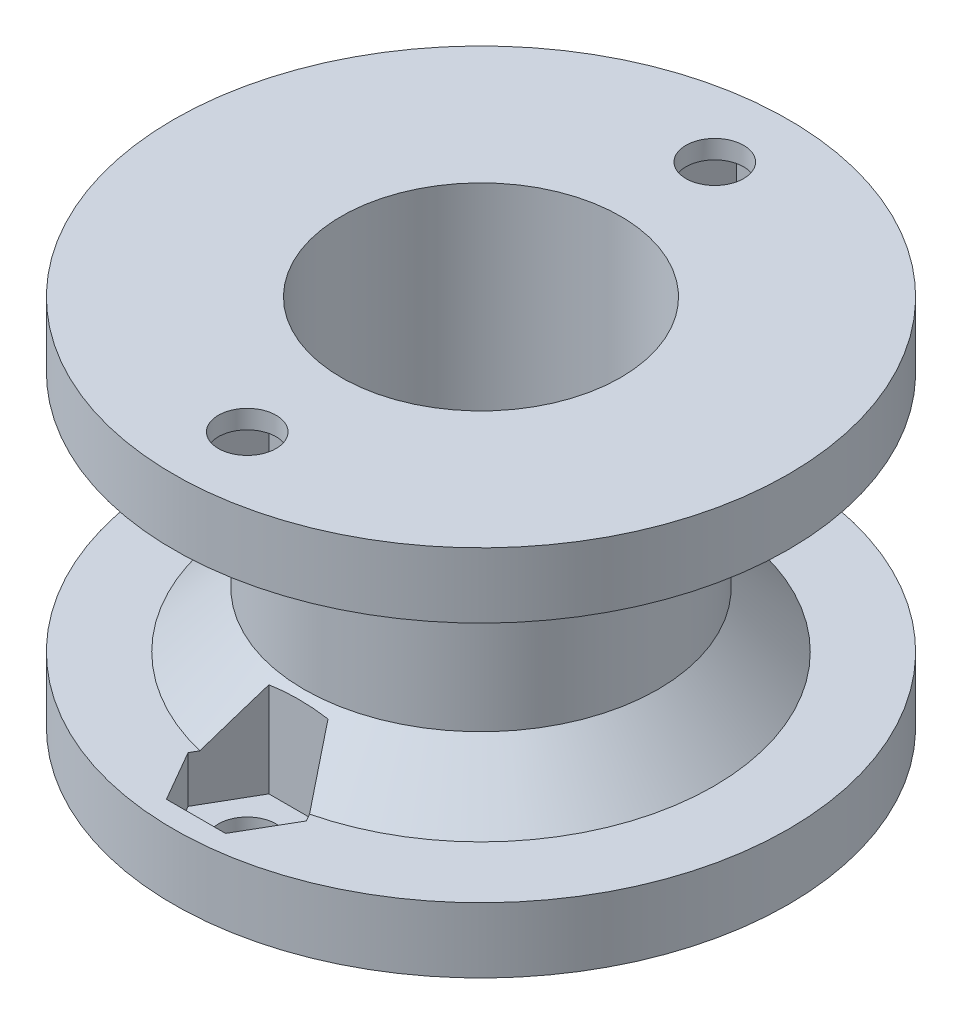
ISO-10303-21;
HEADER;
FILE_DESCRIPTION(('STEP AP214'),'2;1');
FILE_NAME('part.step','',(''),(''),'','','');
FILE_SCHEMA(('AUTOMOTIVE_DESIGN { 1 0 10303 214 1 1 1 1 }'));
ENDSEC;
DATA;
#1=APPLICATION_CONTEXT('core data for automotive mechanical design processes');
#2=APPLICATION_PROTOCOL_DEFINITION('international standard','automotive_design',2000,#1);
#3=PRODUCT_CONTEXT('',#1,'mechanical');
#4=PRODUCT('Part','Part','',(#3));
#5=PRODUCT_RELATED_PRODUCT_CATEGORY('part','',(#4));
#6=PRODUCT_DEFINITION_FORMATION('','',#4);
#7=PRODUCT_DEFINITION_CONTEXT('part definition',#1,'design');
#8=PRODUCT_DEFINITION('design','',#6,#7);
#9=PRODUCT_DEFINITION_SHAPE('','',#8);
#10=(LENGTH_UNIT() NAMED_UNIT(*) SI_UNIT(.MILLI.,.METRE.));
#11=(NAMED_UNIT(*) PLANE_ANGLE_UNIT() SI_UNIT($,.RADIAN.));
#12=(NAMED_UNIT(*) SI_UNIT($,.STERADIAN.) SOLID_ANGLE_UNIT());
#13=UNCERTAINTY_MEASURE_WITH_UNIT(LENGTH_MEASURE(1.E-05),#10,'distance_accuracy_value','');
#14=(GEOMETRIC_REPRESENTATION_CONTEXT(3) GLOBAL_UNCERTAINTY_ASSIGNED_CONTEXT((#13)) GLOBAL_UNIT_ASSIGNED_CONTEXT((#10,
#11,#12)) REPRESENTATION_CONTEXT('',''));
#15=CARTESIAN_POINT('',(0.,0.,0.));
#16=DIRECTION('',(0.,0.,1.));
#17=DIRECTION('',(1.,0.,0.));
#18=AXIS2_PLACEMENT_3D('',#15,#16,#17);
#19=CARTESIAN_POINT('',(-16.5,-6.5,0.));
#20=DIRECTION('',(0.,-1.,0.));
#21=DIRECTION('',(1.,0.,0.));
#22=AXIS2_PLACEMENT_3D('',#19,#20,#21);
#23=PLANE('',#22);
#24=CARTESIAN_POINT('',(0.,-6.5,0.));
#25=DIRECTION('',(0.,-1.,0.));
#26=DIRECTION('',(1.,0.,0.));
#27=AXIS2_PLACEMENT_3D('',#24,#25,#26);
#28=CIRCLE('',#27,16.5);
#29=CARTESIAN_POINT('',(16.5,-6.49999999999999,0.));
#30=VERTEX_POINT('',#29);
#31=EDGE_CURVE('E427',#30,#30,#28,.T.);
#32=ORIENTED_EDGE('',*,*,#31,.F.);
#33=EDGE_LOOP('',(#32));
#34=FACE_BOUND('',#33,.T.);
#35=DIRECTION('',(0.5,0.,-0.866025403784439));
#36=VECTOR('',#35,1.);
#37=CARTESIAN_POINT('',(-7.17773954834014,-6.5,5.38220958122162));
#38=LINE('',#37,#36);
#39=CARTESIAN_POINT('',(2.94360048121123,-6.5,-12.148465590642));
#40=VERTEX_POINT('',#39);
#41=CARTESIAN_POINT('',(3.17542648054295,-6.5,-12.55));
#42=VERTEX_POINT('',#41);
#43=EDGE_CURVE('E495',#40,#42,#38,.T.);
#44=ORIENTED_EDGE('',*,*,#43,.F.);
#45=CARTESIAN_POINT('',(0.,-6.5,0.));
#46=DIRECTION('',(0.,-1.,0.));
#47=DIRECTION('',(1.,0.,0.));
#48=AXIS2_PLACEMENT_3D('',#45,#46,#47);
#49=CIRCLE('',#48,12.5);
#50=CARTESIAN_POINT('',(2.94360048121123,-6.5,12.148465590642));
#51=VERTEX_POINT('',#50);
#52=EDGE_CURVE('E542',#40,#51,#49,.T.);
#53=ORIENTED_EDGE('',*,*,#52,.T.);
#54=DIRECTION('',(-0.5,0.,-0.866025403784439));
#55=VECTOR('',#54,1.);
#56=CARTESIAN_POINT('',(-7.17773954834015,-6.5,-5.38220958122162));
#57=LINE('',#56,#55);
#58=CARTESIAN_POINT('',(3.17542648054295,-6.5,12.55));
#59=VERTEX_POINT('',#58);
#60=EDGE_CURVE('E498',#59,#51,#57,.T.);
#61=ORIENTED_EDGE('',*,*,#60,.F.);
#62=DIRECTION('',(0.5,0.,-0.866025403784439));
#63=VECTOR('',#62,1.);
#64=CARTESIAN_POINT('',(3.69087926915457,-6.5,11.6572095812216));
#65=LINE('',#64,#63);
#66=CARTESIAN_POINT('',(1.58771324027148,-6.5,15.3));
#67=VERTEX_POINT('',#66);
#68=EDGE_CURVE('E502',#67,#59,#65,.T.);
#69=ORIENTED_EDGE('',*,*,#68,.F.);
#70=DIRECTION('',(1.,0.,0.));
#71=VECTOR('',#70,1.);
#72=CARTESIAN_POINT('',(-16.5,-6.5,15.3));
#73=LINE('',#72,#71);
#74=CARTESIAN_POINT('',(-1.58771324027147,-6.5,15.3));
#75=VERTEX_POINT('',#74);
#76=EDGE_CURVE('E505',#75,#67,#73,.T.);
#77=ORIENTED_EDGE('',*,*,#76,.F.);
#78=DIRECTION('',(0.5,0.,0.866025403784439));
#79=VECTOR('',#78,1.);
#80=CARTESIAN_POINT('',(-11.9408792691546,-6.5,-2.63220958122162));
#81=LINE('',#80,#79);
#82=CARTESIAN_POINT('',(-3.17542648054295,-6.5,12.55));
#83=VERTEX_POINT('',#82);
#84=EDGE_CURVE('E508',#83,#75,#81,.T.);
#85=ORIENTED_EDGE('',*,*,#84,.F.);
#86=DIRECTION('',(-0.5,0.,0.866025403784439));
#87=VECTOR('',#86,1.);
#88=CARTESIAN_POINT('',(-1.07226045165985,-6.5,8.90720958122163));
#89=LINE('',#88,#87);
#90=CARTESIAN_POINT('',(-2.94360048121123,-6.5,12.148465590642));
#91=VERTEX_POINT('',#90);
#92=EDGE_CURVE('E511',#91,#83,#89,.T.);
#93=ORIENTED_EDGE('',*,*,#92,.F.);
#94=CARTESIAN_POINT('',(0.,-6.5,0.));
#95=DIRECTION('',(0.,-1.,0.));
#96=DIRECTION('',(1.,0.,0.));
#97=AXIS2_PLACEMENT_3D('',#94,#95,#96);
#98=CIRCLE('',#97,12.5);
#99=CARTESIAN_POINT('',(-2.94360048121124,-6.5,-12.148465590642));
#100=VERTEX_POINT('',#99);
#101=EDGE_CURVE('E539',#91,#100,#98,.T.);
#102=ORIENTED_EDGE('',*,*,#101,.T.);
#103=DIRECTION('',(0.5,0.,0.866025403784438));
#104=VECTOR('',#103,1.);
#105=CARTESIAN_POINT('',(-1.07226045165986,-6.5,-8.90720958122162));
#106=LINE('',#105,#104);
#107=CARTESIAN_POINT('',(-3.17542648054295,-6.5,-12.55));
#108=VERTEX_POINT('',#107);
#109=EDGE_CURVE('E481',#108,#100,#106,.T.);
#110=ORIENTED_EDGE('',*,*,#109,.F.);
#111=DIRECTION('',(-0.5,0.,0.866025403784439));
#112=VECTOR('',#111,1.);
#113=CARTESIAN_POINT('',(-11.9408792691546,-6.5,2.63220958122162));
#114=LINE('',#113,#112);
#115=CARTESIAN_POINT('',(-1.58771324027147,-6.5,-15.3));
#116=VERTEX_POINT('',#115);
#117=EDGE_CURVE('E485',#116,#108,#114,.T.);
#118=ORIENTED_EDGE('',*,*,#117,.F.);
#119=DIRECTION('',(-1.,0.,0.));
#120=VECTOR('',#119,1.);
#121=CARTESIAN_POINT('',(-16.5,-6.5,-15.3));
#122=LINE('',#121,#120);
#123=CARTESIAN_POINT('',(1.58771324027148,-6.5,-15.3));
#124=VERTEX_POINT('',#123);
#125=EDGE_CURVE('E489',#124,#116,#122,.T.);
#126=ORIENTED_EDGE('',*,*,#125,.F.);
#127=DIRECTION('',(-0.5,0.,-0.866025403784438));
#128=VECTOR('',#127,1.);
#129=CARTESIAN_POINT('',(3.69087926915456,-6.5,-11.6572095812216));
#130=LINE('',#129,#128);
#131=EDGE_CURVE('E492',#42,#124,#130,.T.);
#132=ORIENTED_EDGE('',*,*,#131,.F.);
#133=EDGE_LOOP('',(#44,#53,#61,#69,#77,#85,#93,#102,#110,#118,#126,#132));
#134=FACE_BOUND('',#133,.T.);
#135=ADVANCED_FACE('F45',(#34,#134),#23,.F.);
#136=CARTESIAN_POINT('',(0.,-10.,0.));
#137=DIRECTION('',(0.,-1.,0.));
#138=DIRECTION('',(1.,0.,0.));
#139=AXIS2_PLACEMENT_3D('',#136,#137,#138);
#140=CYLINDRICAL_SURFACE('',#139,7.5);
#141=CARTESIAN_POINT('',(0.,10.,0.));
#142=DIRECTION('',(0.,-1.,0.));
#143=DIRECTION('',(1.,0.,0.));
#144=AXIS2_PLACEMENT_3D('',#141,#142,#143);
#145=CIRCLE('',#144,7.5);
#146=CARTESIAN_POINT('',(7.49999999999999,10.,0.));
#147=VERTEX_POINT('',#146);
#148=EDGE_CURVE('E439',#147,#147,#145,.T.);
#149=ORIENTED_EDGE('',*,*,#148,.F.);
#150=EDGE_LOOP('',(#149));
#151=FACE_BOUND('',#150,.T.);
#152=CARTESIAN_POINT('',(0.,-10.,0.));
#153=DIRECTION('',(0.,-1.,0.));
#154=DIRECTION('',(1.,0.,0.));
#155=AXIS2_PLACEMENT_3D('',#152,#153,#154);
#156=CIRCLE('',#155,7.5);
#157=CARTESIAN_POINT('',(7.5,-10.,0.));
#158=VERTEX_POINT('',#157);
#159=EDGE_CURVE('E365',#158,#158,#156,.T.);
#160=ORIENTED_EDGE('',*,*,#159,.T.);
#161=EDGE_LOOP('',(#160));
#162=FACE_BOUND('',#161,.T.);
#163=ADVANCED_FACE('F574',(#151,#162),#140,.F.);
#164=CARTESIAN_POINT('',(-7.5,10.,0.));
#165=DIRECTION('',(0.,-1.,0.));
#166=DIRECTION('',(1.,0.,0.));
#167=AXIS2_PLACEMENT_3D('',#164,#165,#166);
#168=PLANE('',#167);
#169=CARTESIAN_POINT('',(0.,10.,-12.55));
#170=DIRECTION('',(0.,1.,0.));
#171=DIRECTION('',(0.,0.,1.));
#172=AXIS2_PLACEMENT_3D('',#169,#170,#171);
#173=CIRCLE('',#172,1.55);
#174=CARTESIAN_POINT('',(0.,10.,-11.));
#175=VERTEX_POINT('',#174);
#176=EDGE_CURVE('E684',#175,#175,#173,.T.);
#177=ORIENTED_EDGE('',*,*,#176,.F.);
#178=EDGE_LOOP('',(#177));
#179=FACE_BOUND('',#178,.T.);
#180=CARTESIAN_POINT('',(0.,10.,12.55));
#181=DIRECTION('',(0.,1.,0.));
#182=DIRECTION('',(0.,0.,1.));
#183=AXIS2_PLACEMENT_3D('',#180,#181,#182);
#184=CIRCLE('',#183,1.55);
#185=CARTESIAN_POINT('',(0.,10.,14.1));
#186=VERTEX_POINT('',#185);
#187=EDGE_CURVE('E688',#186,#186,#184,.T.);
#188=ORIENTED_EDGE('',*,*,#187,.F.);
#189=EDGE_LOOP('',(#188));
#190=FACE_BOUND('',#189,.T.);
#191=CARTESIAN_POINT('',(0.,10.,0.));
#192=DIRECTION('',(0.,-1.,0.));
#193=DIRECTION('',(1.,0.,0.));
#194=AXIS2_PLACEMENT_3D('',#191,#192,#193);
#195=CIRCLE('',#194,16.5);
#196=CARTESIAN_POINT('',(16.5,10.,0.));
#197=VERTEX_POINT('',#196);
#198=EDGE_CURVE('E435',#197,#197,#195,.T.);
#199=ORIENTED_EDGE('',*,*,#198,.F.);
#200=EDGE_LOOP('',(#199));
#201=FACE_BOUND('',#200,.T.);
#202=ORIENTED_EDGE('',*,*,#148,.T.);
#203=EDGE_LOOP('',(#202));
#204=FACE_BOUND('',#203,.T.);
#205=ADVANCED_FACE('F660',(#179,#190,#201,#204),#168,.F.);
#206=CARTESIAN_POINT('',(0.,-10.,0.));
#207=DIRECTION('',(0.,-1.,0.));
#208=DIRECTION('',(1.,0.,0.));
#209=AXIS2_PLACEMENT_3D('',#206,#207,#208);
#210=CYLINDRICAL_SURFACE('',#209,16.5);
#211=CARTESIAN_POINT('',(0.,6.5,0.));
#212=DIRECTION('',(0.,-1.,0.));
#213=DIRECTION('',(1.,0.,0.));
#214=AXIS2_PLACEMENT_3D('',#211,#212,#213);
#215=CIRCLE('',#214,16.5);
#216=CARTESIAN_POINT('',(16.5,6.50000000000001,0.));
#217=VERTEX_POINT('',#216);
#218=EDGE_CURVE('E431',#217,#217,#215,.T.);
#219=ORIENTED_EDGE('',*,*,#218,.F.);
#220=EDGE_LOOP('',(#219));
#221=FACE_BOUND('',#220,.T.);
#222=ORIENTED_EDGE('',*,*,#198,.T.);
#223=EDGE_LOOP('',(#222));
#224=FACE_BOUND('',#223,.T.);
#225=ADVANCED_FACE('F673',(#221,#224),#210,.T.);
#226=CARTESIAN_POINT('',(-16.5,6.5,0.));
#227=DIRECTION('',(0.,1.,0.));
#228=DIRECTION('',(-1.,0.,0.));
#229=AXIS2_PLACEMENT_3D('',#226,#227,#228);
#230=PLANE('',#229);
#231=DIRECTION('',(-0.5,0.,-0.866025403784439));
#232=VECTOR('',#231,1.);
#233=CARTESIAN_POINT('',(-7.17773954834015,6.5,-5.38220958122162));
#234=LINE('',#233,#232);
#235=CARTESIAN_POINT('',(3.17542648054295,6.5,12.55));
#236=VERTEX_POINT('',#235);
#237=CARTESIAN_POINT('',(2.94360048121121,6.5,12.148465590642));
#238=VERTEX_POINT('',#237);
#239=EDGE_CURVE('E474',#236,#238,#234,.T.);
#240=ORIENTED_EDGE('',*,*,#239,.T.);
#241=CARTESIAN_POINT('',(0.,6.5,0.));
#242=DIRECTION('',(0.,1.,0.));
#243=DIRECTION('',(-1.,0.,0.));
#244=AXIS2_PLACEMENT_3D('',#241,#242,#243);
#245=CIRCLE('',#244,12.5);
#246=CARTESIAN_POINT('',(2.94360048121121,6.5,-12.148465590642));
#247=VERTEX_POINT('',#246);
#248=EDGE_CURVE('E535',#238,#247,#245,.T.);
#249=ORIENTED_EDGE('',*,*,#248,.T.);
#250=DIRECTION('',(0.5,0.,-0.866025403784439));
#251=VECTOR('',#250,1.);
#252=CARTESIAN_POINT('',(-7.17773954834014,6.5,5.38220958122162));
#253=LINE('',#252,#251);
#254=CARTESIAN_POINT('',(3.17542648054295,6.5,-12.55));
#255=VERTEX_POINT('',#254);
#256=EDGE_CURVE('E443',#247,#255,#253,.T.);
#257=ORIENTED_EDGE('',*,*,#256,.T.);
#258=DIRECTION('',(-0.5,0.,-0.866025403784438));
#259=VECTOR('',#258,1.);
#260=CARTESIAN_POINT('',(3.69087926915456,6.5,-11.6572095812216));
#261=LINE('',#260,#259);
#262=CARTESIAN_POINT('',(1.58771324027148,6.5,-15.3));
#263=VERTEX_POINT('',#262);
#264=EDGE_CURVE('E446',#255,#263,#261,.T.);
#265=ORIENTED_EDGE('',*,*,#264,.T.);
#266=DIRECTION('',(-1.,0.,0.));
#267=VECTOR('',#266,1.);
#268=CARTESIAN_POINT('',(-16.5,6.5,-15.3));
#269=LINE('',#268,#267);
#270=CARTESIAN_POINT('',(-1.58771324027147,6.5,-15.3));
#271=VERTEX_POINT('',#270);
#272=EDGE_CURVE('E450',#263,#271,#269,.T.);
#273=ORIENTED_EDGE('',*,*,#272,.T.);
#274=DIRECTION('',(-0.5,0.,0.866025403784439));
#275=VECTOR('',#274,1.);
#276=CARTESIAN_POINT('',(-11.9408792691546,6.5,2.63220958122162));
#277=LINE('',#276,#275);
#278=CARTESIAN_POINT('',(-3.17542648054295,6.5,-12.55));
#279=VERTEX_POINT('',#278);
#280=EDGE_CURVE('E454',#271,#279,#277,.T.);
#281=ORIENTED_EDGE('',*,*,#280,.T.);
#282=DIRECTION('',(0.5,0.,0.866025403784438));
#283=VECTOR('',#282,1.);
#284=CARTESIAN_POINT('',(-1.07226045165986,6.5,-8.90720958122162));
#285=LINE('',#284,#283);
#286=CARTESIAN_POINT('',(-2.94360048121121,6.5,-12.148465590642));
#287=VERTEX_POINT('',#286);
#288=EDGE_CURVE('E458',#279,#287,#285,.T.);
#289=ORIENTED_EDGE('',*,*,#288,.T.);
#290=CARTESIAN_POINT('',(0.,6.5,0.));
#291=DIRECTION('',(0.,1.,0.));
#292=DIRECTION('',(-1.,0.,0.));
#293=AXIS2_PLACEMENT_3D('',#290,#291,#292);
#294=CIRCLE('',#293,12.5);
#295=CARTESIAN_POINT('',(-2.9436004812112,6.5,12.148465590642));
#296=VERTEX_POINT('',#295);
#297=EDGE_CURVE('E532',#287,#296,#294,.T.);
#298=ORIENTED_EDGE('',*,*,#297,.T.);
#299=DIRECTION('',(-0.5,0.,0.866025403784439));
#300=VECTOR('',#299,1.);
#301=CARTESIAN_POINT('',(-1.07226045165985,6.5,8.90720958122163));
#302=LINE('',#301,#300);
#303=CARTESIAN_POINT('',(-3.17542648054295,6.5,12.55));
#304=VERTEX_POINT('',#303);
#305=EDGE_CURVE('E478',#296,#304,#302,.T.);
#306=ORIENTED_EDGE('',*,*,#305,.T.);
#307=DIRECTION('',(0.5,0.,0.866025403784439));
#308=VECTOR('',#307,1.);
#309=CARTESIAN_POINT('',(-11.9408792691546,6.5,-2.63220958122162));
#310=LINE('',#309,#308);
#311=CARTESIAN_POINT('',(-1.58771324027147,6.5,15.3));
#312=VERTEX_POINT('',#311);
#313=EDGE_CURVE('E462',#304,#312,#310,.T.);
#314=ORIENTED_EDGE('',*,*,#313,.T.);
#315=DIRECTION('',(1.,0.,0.));
#316=VECTOR('',#315,1.);
#317=CARTESIAN_POINT('',(-16.5,6.5,15.3));
#318=LINE('',#317,#316);
#319=CARTESIAN_POINT('',(1.58771324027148,6.5,15.3));
#320=VERTEX_POINT('',#319);
#321=EDGE_CURVE('E466',#312,#320,#318,.T.);
#322=ORIENTED_EDGE('',*,*,#321,.T.);
#323=DIRECTION('',(0.5,0.,-0.866025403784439));
#324=VECTOR('',#323,1.);
#325=CARTESIAN_POINT('',(3.69087926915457,6.5,11.6572095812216));
#326=LINE('',#325,#324);
#327=EDGE_CURVE('E470',#320,#236,#326,.T.);
#328=ORIENTED_EDGE('',*,*,#327,.T.);
#329=EDGE_LOOP('',(#240,#249,#257,#265,#273,#281,#289,#298,#306,#314,#322,#328));
#330=FACE_BOUND('',#329,.T.);
#331=ORIENTED_EDGE('',*,*,#218,.T.);
#332=EDGE_LOOP('',(#331));
#333=FACE_BOUND('',#332,.T.);
#334=ADVANCED_FACE('F669',(#330,#333),#230,.F.);
#335=CARTESIAN_POINT('',(0.,-10.,0.));
#336=DIRECTION('',(0.,-1.,0.));
#337=DIRECTION('',(1.,0.,0.));
#338=AXIS2_PLACEMENT_3D('',#335,#336,#337);
#339=CYLINDRICAL_SURFACE('',#338,9.5);
#340=CARTESIAN_POINT('',(0.,3.49999999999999,0.));
#341=DIRECTION('',(0.,1.,0.));
#342=DIRECTION('',(-1.,0.,0.));
#343=AXIS2_PLACEMENT_3D('',#340,#341,#342);
#344=CIRCLE('',#343,9.5);
#345=CARTESIAN_POINT('',(-9.5,3.49999999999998,0.));
#346=VERTEX_POINT('',#345);
#347=EDGE_CURVE('E528',#346,#346,#344,.F.);
#348=ORIENTED_EDGE('',*,*,#347,.T.);
#349=EDGE_LOOP('',(#348));
#350=FACE_BOUND('',#349,.T.);
#351=CARTESIAN_POINT('',(0.,-3.49999999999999,0.));
#352=DIRECTION('',(0.,-1.,0.));
#353=DIRECTION('',(1.,0.,0.));
#354=AXIS2_PLACEMENT_3D('',#351,#352,#353);
#355=CIRCLE('',#354,9.5);
#356=CARTESIAN_POINT('',(9.49999999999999,-3.49999999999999,0.));
#357=VERTEX_POINT('',#356);
#358=EDGE_CURVE('E514',#357,#357,#355,.F.);
#359=ORIENTED_EDGE('',*,*,#358,.T.);
#360=EDGE_LOOP('',(#359));
#361=FACE_BOUND('',#360,.T.);
#362=ADVANCED_FACE('F666',(#350,#361),#339,.T.);
#363=CARTESIAN_POINT('',(0.,-10.,0.));
#364=DIRECTION('',(0.,-1.,0.));
#365=DIRECTION('',(1.,0.,0.));
#366=AXIS2_PLACEMENT_3D('',#363,#364,#365);
#367=CYLINDRICAL_SURFACE('',#366,16.5);
#368=CARTESIAN_POINT('',(0.,-9.99999999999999,0.));
#369=DIRECTION('',(0.,-1.,0.));
#370=DIRECTION('',(1.,0.,0.));
#371=AXIS2_PLACEMENT_3D('',#368,#369,#370);
#372=CIRCLE('',#371,16.5);
#373=CARTESIAN_POINT('',(16.5,-9.99999999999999,0.));
#374=VERTEX_POINT('',#373);
#375=EDGE_CURVE('E423',#374,#374,#372,.T.);
#376=ORIENTED_EDGE('',*,*,#375,.F.);
#377=EDGE_LOOP('',(#376));
#378=FACE_BOUND('',#377,.T.);
#379=ORIENTED_EDGE('',*,*,#31,.T.);
#380=EDGE_LOOP('',(#379));
#381=FACE_BOUND('',#380,.T.);
#382=ADVANCED_FACE('F651',(#378,#381),#367,.T.);
#383=CARTESIAN_POINT('',(-7.5,-10.,0.));
#384=DIRECTION('',(0.,1.,0.));
#385=DIRECTION('',(-1.,0.,0.));
#386=AXIS2_PLACEMENT_3D('',#383,#384,#385);
#387=PLANE('',#386);
#388=CARTESIAN_POINT('',(0.,-10.,-12.55));
#389=DIRECTION('',(0.,1.,0.));
#390=DIRECTION('',(0.,0.,1.));
#391=AXIS2_PLACEMENT_3D('',#388,#389,#390);
#392=CIRCLE('',#391,1.55);
#393=CARTESIAN_POINT('',(0.,-10.,-11.));
#394=VERTEX_POINT('',#393);
#395=EDGE_CURVE('E520',#394,#394,#392,.T.);
#396=ORIENTED_EDGE('',*,*,#395,.T.);
#397=EDGE_LOOP('',(#396));
#398=FACE_BOUND('',#397,.T.);
#399=CARTESIAN_POINT('',(0.,-10.,12.55));
#400=DIRECTION('',(0.,1.,0.));
#401=DIRECTION('',(0.,0.,1.));
#402=AXIS2_PLACEMENT_3D('',#399,#400,#401);
#403=CIRCLE('',#402,1.55);
#404=CARTESIAN_POINT('',(0.,-10.,14.1));
#405=VERTEX_POINT('',#404);
#406=EDGE_CURVE('E1232',#405,#405,#403,.T.);
#407=ORIENTED_EDGE('',*,*,#406,.T.);
#408=EDGE_LOOP('',(#407));
#409=FACE_BOUND('',#408,.T.);
#410=ORIENTED_EDGE('',*,*,#159,.F.);
#411=EDGE_LOOP('',(#410));
#412=FACE_BOUND('',#411,.T.);
#413=ORIENTED_EDGE('',*,*,#375,.T.);
#414=EDGE_LOOP('',(#413));
#415=FACE_BOUND('',#414,.T.);
#416=ADVANCED_FACE('F643',(#398,#409,#412,#415),#387,.F.);
#417=CARTESIAN_POINT('',(1.58771324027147,4.,-9.8));
#418=DIRECTION('',(0.,0.,1.));
#419=DIRECTION('',(1.,0.,0.));
#420=AXIS2_PLACEMENT_3D('',#417,#418,#419);
#421=PLANE('',#420);
#422=DIRECTION('',(0.,1.,0.));
#423=VECTOR('',#422,1.);
#424=CARTESIAN_POINT('',(-1.58771324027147,4.,-9.8));
#425=LINE('',#424,#423);
#426=CARTESIAN_POINT('',(-1.58771324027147,3.92778088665,-9.8));
#427=VERTEX_POINT('',#426);
#428=CARTESIAN_POINT('',(-1.58771324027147,9.,-9.8));
#429=VERTEX_POINT('',#428);
#430=EDGE_CURVE('E287',#427,#429,#425,.T.);
#431=ORIENTED_EDGE('',*,*,#430,.T.);
#432=DIRECTION('',(1.,0.,0.));
#433=VECTOR('',#432,1.);
#434=CARTESIAN_POINT('',(1.58771324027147,9.,-9.8));
#435=LINE('',#434,#433);
#436=CARTESIAN_POINT('',(1.58771324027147,9.,-9.8));
#437=VERTEX_POINT('',#436);
#438=EDGE_CURVE('E341',#429,#437,#435,.T.);
#439=ORIENTED_EDGE('',*,*,#438,.T.);
#440=DIRECTION('',(0.,1.,0.));
#441=VECTOR('',#440,1.);
#442=CARTESIAN_POINT('',(1.58771324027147,4.,-9.8));
#443=LINE('',#442,#441);
#444=CARTESIAN_POINT('',(1.58771324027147,3.92778088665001,-9.8));
#445=VERTEX_POINT('',#444);
#446=EDGE_CURVE('E380',#445,#437,#443,.T.);
#447=ORIENTED_EDGE('',*,*,#446,.F.);
#448=CARTESIAN_POINT('',(1.58771324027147,3.92778088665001,-9.8));
#449=CARTESIAN_POINT('',(1.4560834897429,3.906724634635,-9.8));
#450=CARTESIAN_POINT('',(1.3240617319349,3.88816813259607,-9.8));
#451=CARTESIAN_POINT('',(1.05938490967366,3.85621886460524,-9.8));
#452=CARTESIAN_POINT('',(0.926729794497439,3.84282651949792,-9.8));
#453=CARTESIAN_POINT('',(0.52983608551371,3.81078900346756,-9.8));
#454=CARTESIAN_POINT('',(0.264918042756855,3.79999999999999,-9.8));
#455=CARTESIAN_POINT('',(-0.264918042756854,3.79999999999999,-9.8));
#456=CARTESIAN_POINT('',(-0.529836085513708,3.81078900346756,-9.8));
#457=CARTESIAN_POINT('',(-0.926729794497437,3.84282651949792,-9.8));
#458=CARTESIAN_POINT('',(-1.05938490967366,3.85621886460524,-9.8));
#459=CARTESIAN_POINT('',(-1.3240617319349,3.88816813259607,-9.8));
#460=CARTESIAN_POINT('',(-1.4560834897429,3.90672463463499,-9.8));
#461=CARTESIAN_POINT('',(-1.58771324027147,3.92778088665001,-9.8));
#462=B_SPLINE_CURVE_WITH_KNOTS('',3,(#448,#449,#450,#451,#452,#453,#454,#455,#456,#457,#458,
#459,#460,#461),.UNSPECIFIED.,.F.,.F.,(4,2,2,2,2,2,4),(0.,0.399867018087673,0.799766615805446,
1.59425947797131,2.38875234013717,2.78865193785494,3.18851895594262),.UNSPECIFIED.);
#463=EDGE_CURVE('E555',#445,#427,#462,.T.);
#464=ORIENTED_EDGE('',*,*,#463,.T.);
#465=EDGE_LOOP('',(#431,#439,#447,#464));
#466=FACE_BOUND('',#465,.T.);
#467=ADVANCED_FACE('F639',(#466),#421,.F.);
#468=CARTESIAN_POINT('',(-1.58771324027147,4.,-9.8));
#469=DIRECTION('',(-0.866025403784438,0.,0.5));
#470=DIRECTION('',(0.5,0.,0.866025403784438));
#471=AXIS2_PLACEMENT_3D('',#468,#469,#470);
#472=PLANE('',#471);
#473=DIRECTION('',(0.,1.,0.));
#474=VECTOR('',#473,1.);
#475=CARTESIAN_POINT('',(-3.17542648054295,4.,-12.55));
#476=LINE('',#475,#474);
#477=CARTESIAN_POINT('',(-3.17542648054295,9.,-12.55));
#478=VERTEX_POINT('',#477);
#479=EDGE_CURVE('E393',#279,#478,#476,.T.);
#480=ORIENTED_EDGE('',*,*,#479,.T.);
#481=DIRECTION('',(0.5,0.,0.866025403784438));
#482=VECTOR('',#481,1.);
#483=CARTESIAN_POINT('',(-1.58771324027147,9.,-9.8));
#484=LINE('',#483,#482);
#485=EDGE_CURVE('E383',#478,#429,#484,.T.);
#486=ORIENTED_EDGE('',*,*,#485,.T.);
#487=ORIENTED_EDGE('',*,*,#430,.F.);
#488=CARTESIAN_POINT('',(-1.58771324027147,3.92778088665,-9.8));
#489=CARTESIAN_POINT('',(-1.70147707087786,4.14049729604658,-9.99704473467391));
#490=CARTESIAN_POINT('',(-1.81500172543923,4.353724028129,-10.1936752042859));
#491=CARTESIAN_POINT('',(-2.04164330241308,4.78103805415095,-10.5862299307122));
#492=CARTESIAN_POINT('',(-2.15476022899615,4.99512533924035,-10.7821541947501));
#493=CARTESIAN_POINT('',(-2.38065893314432,5.4240040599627,-11.1734222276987));
#494=CARTESIAN_POINT('',(-2.49344071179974,5.63879549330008,-11.3687659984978));
#495=CARTESIAN_POINT('',(-2.7187208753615,6.06897670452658,-11.7589626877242));
#496=CARTESIAN_POINT('',(-2.83121925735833,6.28436648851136,-11.953815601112));
#497=CARTESIAN_POINT('',(-2.94360048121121,6.5,-12.148465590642));
#498=B_SPLINE_CURVE_WITH_KNOTS('',3,(#488,#489,#490,#491,#492,#493,#494,#495,#496,#497),
.UNSPECIFIED.,.F.,.F.,(4,2,2,2,4),(0.,0.934424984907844,1.86884038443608,2.80325274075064,
3.73767465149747),.UNSPECIFIED.);
#499=EDGE_CURVE('E582',#427,#287,#498,.T.);
#500=ORIENTED_EDGE('',*,*,#499,.T.);
#501=ORIENTED_EDGE('',*,*,#288,.F.);
#502=EDGE_LOOP('',(#480,#486,#487,#500,#501));
#503=FACE_BOUND('',#502,.T.);
#504=ADVANCED_FACE('F642',(#503),#472,.F.);
#505=CARTESIAN_POINT('',(-3.17542648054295,4.,-12.55));
#506=DIRECTION('',(-0.866025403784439,0.,-0.5));
#507=DIRECTION('',(-0.5,0.,0.866025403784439));
#508=AXIS2_PLACEMENT_3D('',#505,#506,#507);
#509=PLANE('',#508);
#510=DIRECTION('',(0.,1.,0.));
#511=VECTOR('',#510,1.);
#512=CARTESIAN_POINT('',(-1.58771324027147,4.,-15.3));
#513=LINE('',#512,#511);
#514=CARTESIAN_POINT('',(-1.58771324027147,9.,-15.3));
#515=VERTEX_POINT('',#514);
#516=EDGE_CURVE('E390',#271,#515,#513,.T.);
#517=ORIENTED_EDGE('',*,*,#516,.T.);
#518=DIRECTION('',(-0.5,0.,0.866025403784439));
#519=VECTOR('',#518,1.);
#520=CARTESIAN_POINT('',(-3.17542648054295,9.,-12.55));
#521=LINE('',#520,#519);
#522=EDGE_CURVE('E401',#515,#478,#521,.T.);
#523=ORIENTED_EDGE('',*,*,#522,.T.);
#524=ORIENTED_EDGE('',*,*,#479,.F.);
#525=ORIENTED_EDGE('',*,*,#280,.F.);
#526=EDGE_LOOP('',(#517,#523,#524,#525));
#527=FACE_BOUND('',#526,.T.);
#528=ADVANCED_FACE('F649',(#527),#509,.F.);
#529=CARTESIAN_POINT('',(-1.58771324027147,4.,-15.3));
#530=DIRECTION('',(0.,0.,-1.));
#531=DIRECTION('',(-1.,0.,0.));
#532=AXIS2_PLACEMENT_3D('',#529,#530,#531);
#533=PLANE('',#532);
#534=DIRECTION('',(0.,1.,0.));
#535=VECTOR('',#534,1.);
#536=CARTESIAN_POINT('',(1.58771324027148,4.,-15.3));
#537=LINE('',#536,#535);
#538=CARTESIAN_POINT('',(1.58771324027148,9.,-15.3));
#539=VERTEX_POINT('',#538);
#540=EDGE_CURVE('E387',#263,#539,#537,.T.);
#541=ORIENTED_EDGE('',*,*,#540,.T.);
#542=DIRECTION('',(-1.,0.,0.));
#543=VECTOR('',#542,1.);
#544=CARTESIAN_POINT('',(-1.58771324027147,9.,-15.3));
#545=LINE('',#544,#543);
#546=EDGE_CURVE('E405',#539,#515,#545,.T.);
#547=ORIENTED_EDGE('',*,*,#546,.T.);
#548=ORIENTED_EDGE('',*,*,#516,.F.);
#549=ORIENTED_EDGE('',*,*,#272,.F.);
#550=EDGE_LOOP('',(#541,#547,#548,#549));
#551=FACE_BOUND('',#550,.T.);
#552=ADVANCED_FACE('F1039',(#551),#533,.F.);
#553=CARTESIAN_POINT('',(1.58771324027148,4.,-15.3));
#554=DIRECTION('',(0.866025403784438,0.,-0.5));
#555=DIRECTION('',(-0.5,0.,-0.866025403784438));
#556=AXIS2_PLACEMENT_3D('',#553,#554,#555);
#557=PLANE('',#556);
#558=DIRECTION('',(0.,1.,0.));
#559=VECTOR('',#558,1.);
#560=CARTESIAN_POINT('',(3.17542648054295,4.,-12.55));
#561=LINE('',#560,#559);
#562=CARTESIAN_POINT('',(3.17542648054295,9.,-12.55));
#563=VERTEX_POINT('',#562);
#564=EDGE_CURVE('E384',#255,#563,#561,.T.);
#565=ORIENTED_EDGE('',*,*,#564,.T.);
#566=DIRECTION('',(-0.5,0.,-0.866025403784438));
#567=VECTOR('',#566,1.);
#568=CARTESIAN_POINT('',(1.58771324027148,9.,-15.3));
#569=LINE('',#568,#567);
#570=EDGE_CURVE('E409',#563,#539,#569,.T.);
#571=ORIENTED_EDGE('',*,*,#570,.T.);
#572=ORIENTED_EDGE('',*,*,#540,.F.);
#573=ORIENTED_EDGE('',*,*,#264,.F.);
#574=EDGE_LOOP('',(#565,#571,#572,#573));
#575=FACE_BOUND('',#574,.T.);
#576=ADVANCED_FACE('F849',(#575),#557,.F.);
#577=CARTESIAN_POINT('',(3.17542648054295,4.,-12.55));
#578=DIRECTION('',(0.866025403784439,0.,0.5));
#579=DIRECTION('',(0.5,0.,-0.866025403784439));
#580=AXIS2_PLACEMENT_3D('',#577,#578,#579);
#581=PLANE('',#580);
#582=ORIENTED_EDGE('',*,*,#446,.T.);
#583=DIRECTION('',(0.5,0.,-0.866025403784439));
#584=VECTOR('',#583,1.);
#585=CARTESIAN_POINT('',(3.17542648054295,9.,-12.55));
#586=LINE('',#585,#584);
#587=EDGE_CURVE('E413',#437,#563,#586,.T.);
#588=ORIENTED_EDGE('',*,*,#587,.T.);
#589=ORIENTED_EDGE('',*,*,#564,.F.);
#590=ORIENTED_EDGE('',*,*,#256,.F.);
#591=CARTESIAN_POINT('',(2.94360048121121,6.5,-12.148465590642));
#592=CARTESIAN_POINT('',(2.83121925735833,6.28436648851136,-11.953815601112));
#593=CARTESIAN_POINT('',(2.7187208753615,6.06897670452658,-11.7589626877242));
#594=CARTESIAN_POINT('',(2.49344071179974,5.63879549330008,-11.3687659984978));
#595=CARTESIAN_POINT('',(2.38065893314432,5.4240040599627,-11.1734222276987));
#596=CARTESIAN_POINT('',(2.15476022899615,4.99512533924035,-10.7821541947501));
#597=CARTESIAN_POINT('',(2.04164330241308,4.78103805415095,-10.5862299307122));
#598=CARTESIAN_POINT('',(1.81500172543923,4.353724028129,-10.1936752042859));
#599=CARTESIAN_POINT('',(1.70147707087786,4.14049729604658,-9.99704473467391));
#600=CARTESIAN_POINT('',(1.58771324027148,3.92778088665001,-9.8));
#601=B_SPLINE_CURVE_WITH_KNOTS('',3,(#591,#592,#593,#594,#595,#596,#597,#598,#599,#600),
.UNSPECIFIED.,.F.,.F.,(4,2,2,2,4),(0.,0.934421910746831,1.86883426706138,2.80324966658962,
3.73767465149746),.UNSPECIFIED.);
#602=EDGE_CURVE('E546',#247,#445,#601,.T.);
#603=ORIENTED_EDGE('',*,*,#602,.T.);
#604=EDGE_LOOP('',(#582,#588,#589,#590,#603));
#605=FACE_BOUND('',#604,.T.);
#606=ADVANCED_FACE('F562',(#605),#581,.F.);
#607=CARTESIAN_POINT('',(0.,9.,0.));
#608=DIRECTION('',(0.,-1.,0.));
#609=DIRECTION('',(0.,0.,-1.));
#610=AXIS2_PLACEMENT_3D('',#607,#608,#609);
#611=PLANE('',#610);
#612=CARTESIAN_POINT('',(0.,9.,-12.55));
#613=DIRECTION('',(0.,-1.,0.));
#614=DIRECTION('',(0.,0.,-1.));
#615=AXIS2_PLACEMENT_3D('',#612,#613,#614);
#616=CIRCLE('',#615,1.55);
#617=CARTESIAN_POINT('',(0.,9.,-14.1));
#618=VERTEX_POINT('',#617);
#619=EDGE_CURVE('E271',#618,#618,#616,.T.);
#620=ORIENTED_EDGE('',*,*,#619,.F.);
#621=EDGE_LOOP('',(#620));
#622=FACE_BOUND('',#621,.T.);
#623=ORIENTED_EDGE('',*,*,#438,.F.);
#624=ORIENTED_EDGE('',*,*,#485,.F.);
#625=ORIENTED_EDGE('',*,*,#522,.F.);
#626=ORIENTED_EDGE('',*,*,#546,.F.);
#627=ORIENTED_EDGE('',*,*,#570,.F.);
#628=ORIENTED_EDGE('',*,*,#587,.F.);
#629=EDGE_LOOP('',(#623,#624,#625,#626,#627,#628));
#630=FACE_BOUND('',#629,.T.);
#631=ADVANCED_FACE('F637',(#622,#630),#611,.T.);
#632=CARTESIAN_POINT('',(-1.58771324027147,4.,9.8));
#633=DIRECTION('',(-0.866025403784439,0.,-0.5));
#634=DIRECTION('',(-0.5,0.,0.866025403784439));
#635=AXIS2_PLACEMENT_3D('',#632,#633,#634);
#636=PLANE('',#635);
#637=DIRECTION('',(0.,1.,0.));
#638=VECTOR('',#637,1.);
#639=CARTESIAN_POINT('',(-1.58771324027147,4.,9.8));
#640=LINE('',#639,#638);
#641=CARTESIAN_POINT('',(-1.58771324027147,3.92778088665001,9.8));
#642=VERTEX_POINT('',#641);
#643=CARTESIAN_POINT('',(-1.58771324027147,9.,9.8));
#644=VERTEX_POINT('',#643);
#645=EDGE_CURVE('E362',#642,#644,#640,.T.);
#646=ORIENTED_EDGE('',*,*,#645,.T.);
#647=DIRECTION('',(-0.5,0.,0.866025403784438));
#648=VECTOR('',#647,1.);
#649=CARTESIAN_POINT('',(-1.58771324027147,9.,9.8));
#650=LINE('',#649,#648);
#651=CARTESIAN_POINT('',(-3.17542648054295,9.,12.55));
#652=VERTEX_POINT('',#651);
#653=EDGE_CURVE('E336',#644,#652,#650,.T.);
#654=ORIENTED_EDGE('',*,*,#653,.T.);
#655=DIRECTION('',(0.,1.,0.));
#656=VECTOR('',#655,1.);
#657=CARTESIAN_POINT('',(-3.17542648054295,4.,12.55));
#658=LINE('',#657,#656);
#659=EDGE_CURVE('E361',#304,#652,#658,.T.);
#660=ORIENTED_EDGE('',*,*,#659,.F.);
#661=ORIENTED_EDGE('',*,*,#305,.F.);
#662=CARTESIAN_POINT('',(-2.9436004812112,6.5,12.148465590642));
#663=CARTESIAN_POINT('',(-2.83121925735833,6.28436648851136,11.953815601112));
#664=CARTESIAN_POINT('',(-2.7187208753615,6.06897670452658,11.7589626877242));
#665=CARTESIAN_POINT('',(-2.49344071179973,5.63879549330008,11.3687659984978));
#666=CARTESIAN_POINT('',(-2.38065893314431,5.4240040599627,11.1734222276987));
#667=CARTESIAN_POINT('',(-2.15476022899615,4.99512533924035,10.7821541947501));
#668=CARTESIAN_POINT('',(-2.04164330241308,4.78103805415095,10.5862299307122));
#669=CARTESIAN_POINT('',(-1.81500172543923,4.353724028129,10.1936752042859));
#670=CARTESIAN_POINT('',(-1.70147707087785,4.14049729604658,9.99704473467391));
#671=CARTESIAN_POINT('',(-1.58771324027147,3.92778088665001,9.8));
#672=B_SPLINE_CURVE_WITH_KNOTS('',3,(#662,#663,#664,#665,#666,#667,#668,#669,#670,#671),
.UNSPECIFIED.,.F.,.F.,(4,2,2,2,4),(0.,0.934421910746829,1.86883426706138,2.80324966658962,
3.73767465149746),.UNSPECIFIED.);
#673=EDGE_CURVE('E589',#296,#642,#672,.T.);
#674=ORIENTED_EDGE('',*,*,#673,.T.);
#675=EDGE_LOOP('',(#646,#654,#660,#661,#674));
#676=FACE_BOUND('',#675,.T.);
#677=ADVANCED_FACE('F616',(#676),#636,.F.);
#678=CARTESIAN_POINT('',(1.58771324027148,4.,9.8));
#679=DIRECTION('',(0.,0.,-1.));
#680=DIRECTION('',(-1.,0.,0.));
#681=AXIS2_PLACEMENT_3D('',#678,#679,#680);
#682=PLANE('',#681);
#683=DIRECTION('',(0.,1.,0.));
#684=VECTOR('',#683,1.);
#685=CARTESIAN_POINT('',(1.58771324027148,4.,9.8));
#686=LINE('',#685,#684);
#687=CARTESIAN_POINT('',(1.58771324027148,3.92778088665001,9.8));
#688=VERTEX_POINT('',#687);
#689=CARTESIAN_POINT('',(1.58771324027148,9.,9.8));
#690=VERTEX_POINT('',#689);
#691=EDGE_CURVE('E366',#688,#690,#686,.T.);
#692=ORIENTED_EDGE('',*,*,#691,.T.);
#693=DIRECTION('',(-1.,0.,0.));
#694=VECTOR('',#693,1.);
#695=CARTESIAN_POINT('',(1.58771324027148,9.,9.8));
#696=LINE('',#695,#694);
#697=EDGE_CURVE('E357',#690,#644,#696,.T.);
#698=ORIENTED_EDGE('',*,*,#697,.T.);
#699=ORIENTED_EDGE('',*,*,#645,.F.);
#700=CARTESIAN_POINT('',(-1.58771324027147,3.92778088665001,9.8));
#701=CARTESIAN_POINT('',(-1.4560834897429,3.906724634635,9.8));
#702=CARTESIAN_POINT('',(-1.3240617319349,3.88816813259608,9.8));
#703=CARTESIAN_POINT('',(-1.05938490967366,3.85621886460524,9.8));
#704=CARTESIAN_POINT('',(-0.926729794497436,3.84282651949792,9.8));
#705=CARTESIAN_POINT('',(-0.529836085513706,3.81078900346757,9.8));
#706=CARTESIAN_POINT('',(-0.264918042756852,3.79999999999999,9.8));
#707=CARTESIAN_POINT('',(0.264918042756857,3.79999999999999,9.8));
#708=CARTESIAN_POINT('',(0.529836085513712,3.81078900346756,9.8));
#709=CARTESIAN_POINT('',(0.926729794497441,3.84282651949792,9.8));
#710=CARTESIAN_POINT('',(1.05938490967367,3.85621886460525,9.8));
#711=CARTESIAN_POINT('',(1.3240617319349,3.88816813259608,9.8));
#712=CARTESIAN_POINT('',(1.4560834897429,3.906724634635,9.8));
#713=CARTESIAN_POINT('',(1.58771324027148,3.92778088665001,9.8));
#714=B_SPLINE_CURVE_WITH_KNOTS('',3,(#700,#701,#702,#703,#704,#705,#706,#707,#708,#709,#710,
#711,#712,#713),.UNSPECIFIED.,.F.,.F.,(4,2,2,2,2,2,4),(0.,0.399867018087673,0.799766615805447,
1.59425947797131,2.38875234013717,2.78865193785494,3.18851895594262),.UNSPECIFIED.);
#715=EDGE_CURVE('E596',#642,#688,#714,.T.);
#716=ORIENTED_EDGE('',*,*,#715,.T.);
#717=EDGE_LOOP('',(#692,#698,#699,#716));
#718=FACE_BOUND('',#717,.T.);
#719=ADVANCED_FACE('F611',(#718),#682,.F.);
#720=CARTESIAN_POINT('',(3.17542648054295,4.,12.55));
#721=DIRECTION('',(0.866025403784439,0.,-0.5));
#722=DIRECTION('',(-0.5,0.,-0.866025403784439));
#723=AXIS2_PLACEMENT_3D('',#720,#721,#722);
#724=PLANE('',#723);
#725=DIRECTION('',(0.,1.,0.));
#726=VECTOR('',#725,1.);
#727=CARTESIAN_POINT('',(3.17542648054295,4.,12.55));
#728=LINE('',#727,#726);
#729=CARTESIAN_POINT('',(3.17542648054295,9.,12.55));
#730=VERTEX_POINT('',#729);
#731=EDGE_CURVE('E369',#236,#730,#728,.T.);
#732=ORIENTED_EDGE('',*,*,#731,.T.);
#733=DIRECTION('',(-0.5,0.,-0.866025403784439));
#734=VECTOR('',#733,1.);
#735=CARTESIAN_POINT('',(3.17542648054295,9.,12.55));
#736=LINE('',#735,#734);
#737=EDGE_CURVE('E353',#730,#690,#736,.T.);
#738=ORIENTED_EDGE('',*,*,#737,.T.);
#739=ORIENTED_EDGE('',*,*,#691,.F.);
#740=CARTESIAN_POINT('',(1.58771324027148,3.92778088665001,9.8));
#741=CARTESIAN_POINT('',(1.70147707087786,4.14049729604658,9.99704473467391));
#742=CARTESIAN_POINT('',(1.81500172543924,4.353724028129,10.1936752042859));
#743=CARTESIAN_POINT('',(2.04164330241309,4.78103805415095,10.5862299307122));
#744=CARTESIAN_POINT('',(2.15476022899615,4.99512533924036,10.7821541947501));
#745=CARTESIAN_POINT('',(2.38065893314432,5.4240040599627,11.1734222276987));
#746=CARTESIAN_POINT('',(2.49344071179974,5.63879549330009,11.3687659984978));
#747=CARTESIAN_POINT('',(2.7187208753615,6.06897670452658,11.7589626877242));
#748=CARTESIAN_POINT('',(2.83121925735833,6.28436648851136,11.953815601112));
#749=CARTESIAN_POINT('',(2.94360048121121,6.5,12.148465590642));
#750=B_SPLINE_CURVE_WITH_KNOTS('',3,(#740,#741,#742,#743,#744,#745,#746,#747,#748,#749),
.UNSPECIFIED.,.F.,.F.,(4,2,2,2,4),(0.,0.934424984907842,1.86884038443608,2.80325274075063,
3.73767465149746),.UNSPECIFIED.);
#751=EDGE_CURVE('E604',#688,#238,#750,.T.);
#752=ORIENTED_EDGE('',*,*,#751,.T.);
#753=ORIENTED_EDGE('',*,*,#239,.F.);
#754=EDGE_LOOP('',(#732,#738,#739,#752,#753));
#755=FACE_BOUND('',#754,.T.);
#756=ADVANCED_FACE('F615',(#755),#724,.F.);
#757=CARTESIAN_POINT('',(1.58771324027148,4.,15.3));
#758=DIRECTION('',(0.866025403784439,0.,0.5));
#759=DIRECTION('',(0.5,0.,-0.866025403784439));
#760=AXIS2_PLACEMENT_3D('',#757,#758,#759);
#761=PLANE('',#760);
#762=DIRECTION('',(0.,1.,0.));
#763=VECTOR('',#762,1.);
#764=CARTESIAN_POINT('',(1.58771324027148,4.,15.3));
#765=LINE('',#764,#763);
#766=CARTESIAN_POINT('',(1.58771324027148,9.,15.3));
#767=VERTEX_POINT('',#766);
#768=EDGE_CURVE('E372',#320,#767,#765,.T.);
#769=ORIENTED_EDGE('',*,*,#768,.T.);
#770=DIRECTION('',(0.5,0.,-0.866025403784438));
#771=VECTOR('',#770,1.);
#772=CARTESIAN_POINT('',(1.58771324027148,9.,15.3));
#773=LINE('',#772,#771);
#774=EDGE_CURVE('E349',#767,#730,#773,.T.);
#775=ORIENTED_EDGE('',*,*,#774,.T.);
#776=ORIENTED_EDGE('',*,*,#731,.F.);
#777=ORIENTED_EDGE('',*,*,#327,.F.);
#778=EDGE_LOOP('',(#769,#775,#776,#777));
#779=FACE_BOUND('',#778,.T.);
#780=ADVANCED_FACE('F623',(#779),#761,.F.);
#781=CARTESIAN_POINT('',(-1.58771324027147,4.,15.3));
#782=DIRECTION('',(0.,0.,1.));
#783=DIRECTION('',(1.,0.,0.));
#784=AXIS2_PLACEMENT_3D('',#781,#782,#783);
#785=PLANE('',#784);
#786=DIRECTION('',(0.,1.,0.));
#787=VECTOR('',#786,1.);
#788=CARTESIAN_POINT('',(-1.58771324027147,4.,15.3));
#789=LINE('',#788,#787);
#790=CARTESIAN_POINT('',(-1.58771324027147,9.,15.3));
#791=VERTEX_POINT('',#790);
#792=EDGE_CURVE('E375',#312,#791,#789,.T.);
#793=ORIENTED_EDGE('',*,*,#792,.T.);
#794=DIRECTION('',(1.,0.,0.));
#795=VECTOR('',#794,1.);
#796=CARTESIAN_POINT('',(-1.58771324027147,9.,15.3));
#797=LINE('',#796,#795);
#798=EDGE_CURVE('E345',#791,#767,#797,.T.);
#799=ORIENTED_EDGE('',*,*,#798,.T.);
#800=ORIENTED_EDGE('',*,*,#768,.F.);
#801=ORIENTED_EDGE('',*,*,#321,.F.);
#802=EDGE_LOOP('',(#793,#799,#800,#801));
#803=FACE_BOUND('',#802,.T.);
#804=ADVANCED_FACE('F627',(#803),#785,.F.);
#805=CARTESIAN_POINT('',(-3.17542648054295,4.,12.55));
#806=DIRECTION('',(-0.866025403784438,0.,0.5));
#807=DIRECTION('',(0.5,0.,0.866025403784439));
#808=AXIS2_PLACEMENT_3D('',#805,#806,#807);
#809=PLANE('',#808);
#810=ORIENTED_EDGE('',*,*,#659,.T.);
#811=DIRECTION('',(0.5,0.,0.866025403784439));
#812=VECTOR('',#811,1.);
#813=CARTESIAN_POINT('',(-3.17542648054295,9.,12.55));
#814=LINE('',#813,#812);
#815=EDGE_CURVE('E340',#652,#791,#814,.T.);
#816=ORIENTED_EDGE('',*,*,#815,.T.);
#817=ORIENTED_EDGE('',*,*,#792,.F.);
#818=ORIENTED_EDGE('',*,*,#313,.F.);
#819=EDGE_LOOP('',(#810,#816,#817,#818));
#820=FACE_BOUND('',#819,.T.);
#821=ADVANCED_FACE('F631',(#820),#809,.F.);
#822=CARTESIAN_POINT('',(0.,9.,0.));
#823=DIRECTION('',(0.,1.,0.));
#824=DIRECTION('',(0.,0.,1.));
#825=AXIS2_PLACEMENT_3D('',#822,#823,#824);
#826=PLANE('',#825);
#827=CARTESIAN_POINT('',(0.,9.,12.55));
#828=DIRECTION('',(0.,1.,0.));
#829=DIRECTION('',(0.,0.,1.));
#830=AXIS2_PLACEMENT_3D('',#827,#828,#829);
#831=CIRCLE('',#830,1.55);
#832=CARTESIAN_POINT('',(0.,9.,14.1));
#833=VERTEX_POINT('',#832);
#834=EDGE_CURVE('E519',#833,#833,#831,.T.);
#835=ORIENTED_EDGE('',*,*,#834,.T.);
#836=EDGE_LOOP('',(#835));
#837=FACE_BOUND('',#836,.T.);
#838=ORIENTED_EDGE('',*,*,#653,.F.);
#839=ORIENTED_EDGE('',*,*,#697,.F.);
#840=ORIENTED_EDGE('',*,*,#737,.F.);
#841=ORIENTED_EDGE('',*,*,#774,.F.);
#842=ORIENTED_EDGE('',*,*,#798,.F.);
#843=ORIENTED_EDGE('',*,*,#815,.F.);
#844=EDGE_LOOP('',(#838,#839,#840,#841,#842,#843));
#845=FACE_BOUND('',#844,.T.);
#846=ADVANCED_FACE('F618',(#837,#845),#826,.F.);
#847=CARTESIAN_POINT('',(1.58771324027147,-4.,-9.8));
#848=DIRECTION('',(0.,0.,-1.));
#849=DIRECTION('',(-1.,0.,0.));
#850=AXIS2_PLACEMENT_3D('',#847,#848,#849);
#851=PLANE('',#850);
#852=DIRECTION('',(0.,-1.,0.));
#853=VECTOR('',#852,1.);
#854=CARTESIAN_POINT('',(-1.58771324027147,-4.,-9.8));
#855=LINE('',#854,#853);
#856=CARTESIAN_POINT('',(-1.58771324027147,-3.92778088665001,-9.8));
#857=VERTEX_POINT('',#856);
#858=CARTESIAN_POINT('',(-1.58771324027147,-9.,-9.8));
#859=VERTEX_POINT('',#858);
#860=EDGE_CURVE('E74',#857,#859,#855,.T.);
#861=ORIENTED_EDGE('',*,*,#860,.F.);
#862=CARTESIAN_POINT('',(-1.58771324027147,-3.92778088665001,-9.8));
#863=CARTESIAN_POINT('',(-1.4560834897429,-3.90672463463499,-9.8));
#864=CARTESIAN_POINT('',(-1.3240617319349,-3.88816813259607,-9.8));
#865=CARTESIAN_POINT('',(-1.05938490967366,-3.85621886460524,-9.8));
#866=CARTESIAN_POINT('',(-0.926729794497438,-3.84282651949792,-9.8));
#867=CARTESIAN_POINT('',(-0.529836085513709,-3.81078900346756,-9.8));
#868=CARTESIAN_POINT('',(-0.264918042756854,-3.79999999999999,-9.8));
#869=CARTESIAN_POINT('',(0.264918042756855,-3.79999999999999,-9.8));
#870=CARTESIAN_POINT('',(0.529836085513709,-3.81078900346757,-9.8));
#871=CARTESIAN_POINT('',(0.926729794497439,-3.84282651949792,-9.8));
#872=CARTESIAN_POINT('',(1.05938490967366,-3.85621886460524,-9.8));
#873=CARTESIAN_POINT('',(1.3240617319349,-3.88816813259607,-9.8));
#874=CARTESIAN_POINT('',(1.4560834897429,-3.906724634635,-9.8));
#875=CARTESIAN_POINT('',(1.58771324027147,-3.92778088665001,-9.8));
#876=B_SPLINE_CURVE_WITH_KNOTS('',3,(#862,#863,#864,#865,#866,#867,#868,#869,#870,#871,#872,
#873,#874,#875),.UNSPECIFIED.,.F.,.F.,(4,2,2,2,2,2,4),(0.,0.399867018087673,0.799766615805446,
1.59425947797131,2.38875234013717,2.78865193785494,3.18851895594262),.UNSPECIFIED.);
#877=CARTESIAN_POINT('',(1.58771324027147,-3.92778088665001,-9.8));
#878=VERTEX_POINT('',#877);
#879=EDGE_CURVE('E61',#857,#878,#876,.T.);
#880=ORIENTED_EDGE('',*,*,#879,.T.);
#881=DIRECTION('',(0.,-1.,0.));
#882=VECTOR('',#881,1.);
#883=CARTESIAN_POINT('',(1.58771324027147,-4.,-9.8));
#884=LINE('',#883,#882);
#885=CARTESIAN_POINT('',(1.58771324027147,-9.,-9.8));
#886=VERTEX_POINT('',#885);
#887=EDGE_CURVE('E67',#878,#886,#884,.T.);
#888=ORIENTED_EDGE('',*,*,#887,.T.);
#889=DIRECTION('',(1.,0.,0.));
#890=VECTOR('',#889,1.);
#891=CARTESIAN_POINT('',(1.58771324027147,-9.,-9.8));
#892=LINE('',#891,#890);
#893=EDGE_CURVE('E299',#859,#886,#892,.T.);
#894=ORIENTED_EDGE('',*,*,#893,.F.);
#895=EDGE_LOOP('',(#861,#880,#888,#894));
#896=FACE_BOUND('',#895,.T.);
#897=ADVANCED_FACE('F737',(#896),#851,.T.);
#898=CARTESIAN_POINT('',(3.17542648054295,-4.,-12.55));
#899=DIRECTION('',(-0.866025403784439,0.,-0.5));
#900=DIRECTION('',(-0.5,0.,0.866025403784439));
#901=AXIS2_PLACEMENT_3D('',#898,#899,#900);
#902=PLANE('',#901);
#903=ORIENTED_EDGE('',*,*,#887,.F.);
#904=CARTESIAN_POINT('',(1.58771324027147,-3.92778088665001,-9.8));
#905=CARTESIAN_POINT('',(1.70147707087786,-4.14049729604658,-9.99704473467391));
#906=CARTESIAN_POINT('',(1.81500172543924,-4.353724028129,-10.1936752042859));
#907=CARTESIAN_POINT('',(2.04164330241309,-4.78103805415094,-10.5862299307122));
#908=CARTESIAN_POINT('',(2.15476022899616,-4.99512533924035,-10.7821541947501));
#909=CARTESIAN_POINT('',(2.38065893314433,-5.4240040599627,-11.1734222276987));
#910=CARTESIAN_POINT('',(2.49344071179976,-5.63879549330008,-11.3687659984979));
#911=CARTESIAN_POINT('',(2.71872087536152,-6.06897670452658,-11.7589626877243));
#912=CARTESIAN_POINT('',(2.83121925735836,-6.28436648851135,-11.9538156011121));
#913=CARTESIAN_POINT('',(2.94360048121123,-6.5,-12.148465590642));
#914=B_SPLINE_CURVE_WITH_KNOTS('',3,(#904,#905,#906,#907,#908,#909,#910,#911,#912,#913),
.UNSPECIFIED.,.F.,.F.,(4,2,2,2,4),(0.,0.934424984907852,1.8688403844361,2.80325274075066,
3.7376746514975),.UNSPECIFIED.);
#915=EDGE_CURVE('E11',#878,#40,#914,.T.);
#916=ORIENTED_EDGE('',*,*,#915,.T.);
#917=ORIENTED_EDGE('',*,*,#43,.T.);
#918=DIRECTION('',(0.,-1.,0.));
#919=VECTOR('',#918,1.);
#920=CARTESIAN_POINT('',(3.17542648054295,-4.,-12.55));
#921=LINE('',#920,#919);
#922=CARTESIAN_POINT('',(3.17542648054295,-9.,-12.55));
#923=VERTEX_POINT('',#922);
#924=EDGE_CURVE('E268',#42,#923,#921,.T.);
#925=ORIENTED_EDGE('',*,*,#924,.T.);
#926=DIRECTION('',(0.5,0.,-0.866025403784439));
#927=VECTOR('',#926,1.);
#928=CARTESIAN_POINT('',(3.17542648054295,-9.,-12.55));
#929=LINE('',#928,#927);
#930=EDGE_CURVE('E319',#886,#923,#929,.T.);
#931=ORIENTED_EDGE('',*,*,#930,.F.);
#932=EDGE_LOOP('',(#903,#916,#917,#925,#931));
#933=FACE_BOUND('',#932,.T.);
#934=ADVANCED_FACE('F880',(#933),#902,.T.);
#935=CARTESIAN_POINT('',(1.58771324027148,-4.,-15.3));
#936=DIRECTION('',(-0.866025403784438,0.,0.5));
#937=DIRECTION('',(0.5,0.,0.866025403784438));
#938=AXIS2_PLACEMENT_3D('',#935,#936,#937);
#939=PLANE('',#938);
#940=ORIENTED_EDGE('',*,*,#131,.T.);
#941=DIRECTION('',(0.,-1.,0.));
#942=VECTOR('',#941,1.);
#943=CARTESIAN_POINT('',(1.58771324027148,-4.,-15.3));
#944=LINE('',#943,#942);
#945=CARTESIAN_POINT('',(1.58771324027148,-9.,-15.3));
#946=VERTEX_POINT('',#945);
#947=EDGE_CURVE('E325',#124,#946,#944,.T.);
#948=ORIENTED_EDGE('',*,*,#947,.T.);
#949=DIRECTION('',(-0.5,0.,-0.866025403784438));
#950=VECTOR('',#949,1.);
#951=CARTESIAN_POINT('',(1.58771324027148,-9.,-15.3));
#952=LINE('',#951,#950);
#953=EDGE_CURVE('E315',#923,#946,#952,.T.);
#954=ORIENTED_EDGE('',*,*,#953,.F.);
#955=ORIENTED_EDGE('',*,*,#924,.F.);
#956=EDGE_LOOP('',(#940,#948,#954,#955));
#957=FACE_BOUND('',#956,.T.);
#958=ADVANCED_FACE('F889',(#957),#939,.T.);
#959=CARTESIAN_POINT('',(-1.58771324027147,-4.,-15.3));
#960=DIRECTION('',(0.,0.,1.));
#961=DIRECTION('',(1.,0.,0.));
#962=AXIS2_PLACEMENT_3D('',#959,#960,#961);
#963=PLANE('',#962);
#964=ORIENTED_EDGE('',*,*,#125,.T.);
#965=DIRECTION('',(0.,-1.,0.));
#966=VECTOR('',#965,1.);
#967=CARTESIAN_POINT('',(-1.58771324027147,-4.,-15.3));
#968=LINE('',#967,#966);
#969=CARTESIAN_POINT('',(-1.58771324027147,-9.,-15.3));
#970=VERTEX_POINT('',#969);
#971=EDGE_CURVE('E328',#116,#970,#968,.T.);
#972=ORIENTED_EDGE('',*,*,#971,.T.);
#973=DIRECTION('',(-1.,0.,0.));
#974=VECTOR('',#973,1.);
#975=CARTESIAN_POINT('',(-1.58771324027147,-9.,-15.3));
#976=LINE('',#975,#974);
#977=EDGE_CURVE('E311',#946,#970,#976,.T.);
#978=ORIENTED_EDGE('',*,*,#977,.F.);
#979=ORIENTED_EDGE('',*,*,#947,.F.);
#980=EDGE_LOOP('',(#964,#972,#978,#979));
#981=FACE_BOUND('',#980,.T.);
#982=ADVANCED_FACE('F990',(#981),#963,.T.);
#983=CARTESIAN_POINT('',(-3.17542648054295,-4.,-12.55));
#984=DIRECTION('',(0.866025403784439,0.,0.5));
#985=DIRECTION('',(0.5,0.,-0.866025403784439));
#986=AXIS2_PLACEMENT_3D('',#983,#984,#985);
#987=PLANE('',#986);
#988=ORIENTED_EDGE('',*,*,#117,.T.);
#989=DIRECTION('',(0.,-1.,0.));
#990=VECTOR('',#989,1.);
#991=CARTESIAN_POINT('',(-3.17542648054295,-4.,-12.55));
#992=LINE('',#991,#990);
#993=CARTESIAN_POINT('',(-3.17542648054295,-9.,-12.55));
#994=VERTEX_POINT('',#993);
#995=EDGE_CURVE('E331',#108,#994,#992,.T.);
#996=ORIENTED_EDGE('',*,*,#995,.T.);
#997=DIRECTION('',(-0.5,0.,0.866025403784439));
#998=VECTOR('',#997,1.);
#999=CARTESIAN_POINT('',(-3.17542648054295,-9.,-12.55));
#1000=LINE('',#999,#998);
#1001=EDGE_CURVE('E307',#970,#994,#1000,.T.);
#1002=ORIENTED_EDGE('',*,*,#1001,.F.);
#1003=ORIENTED_EDGE('',*,*,#971,.F.);
#1004=EDGE_LOOP('',(#988,#996,#1002,#1003));
#1005=FACE_BOUND('',#1004,.T.);
#1006=ADVANCED_FACE('F898',(#1005),#987,.T.);
#1007=CARTESIAN_POINT('',(-1.58771324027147,-4.,-9.8));
#1008=DIRECTION('',(0.866025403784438,0.,-0.5));
#1009=DIRECTION('',(-0.5,0.,-0.866025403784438));
#1010=AXIS2_PLACEMENT_3D('',#1007,#1008,#1009);
#1011=PLANE('',#1010);
#1012=ORIENTED_EDGE('',*,*,#109,.T.);
#1013=CARTESIAN_POINT('',(-2.94360048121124,-6.5,-12.148465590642));
#1014=CARTESIAN_POINT('',(-2.83121925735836,-6.28436648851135,-11.9538156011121));
#1015=CARTESIAN_POINT('',(-2.71872087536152,-6.06897670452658,-11.7589626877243));
#1016=CARTESIAN_POINT('',(-2.49344071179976,-5.63879549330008,-11.3687659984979));
#1017=CARTESIAN_POINT('',(-2.38065893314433,-5.4240040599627,-11.1734222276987));
#1018=CARTESIAN_POINT('',(-2.15476022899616,-4.99512533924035,-10.7821541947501));
#1019=CARTESIAN_POINT('',(-2.04164330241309,-4.78103805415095,-10.5862299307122));
#1020=CARTESIAN_POINT('',(-1.81500172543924,-4.353724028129,-10.1936752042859));
#1021=CARTESIAN_POINT('',(-1.70147707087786,-4.14049729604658,-9.99704473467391));
#1022=CARTESIAN_POINT('',(-1.58771324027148,-3.92778088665,-9.8));
#1023=B_SPLINE_CURVE_WITH_KNOTS('',3,(#1013,#1014,#1015,#1016,#1017,#1018,#1019,#1020,#1021,
#1022),.UNSPECIFIED.,.F.,.F.,(4,2,2,2,4),(0.,0.93442191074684,1.8688342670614,2.80324966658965,
3.7376746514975),.UNSPECIFIED.);
#1024=EDGE_CURVE('E1147',#100,#857,#1023,.T.);
#1025=ORIENTED_EDGE('',*,*,#1024,.T.);
#1026=ORIENTED_EDGE('',*,*,#860,.T.);
#1027=DIRECTION('',(0.5,0.,0.866025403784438));
#1028=VECTOR('',#1027,1.);
#1029=CARTESIAN_POINT('',(-1.58771324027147,-9.,-9.8));
#1030=LINE('',#1029,#1028);
#1031=EDGE_CURVE('E303',#994,#859,#1030,.T.);
#1032=ORIENTED_EDGE('',*,*,#1031,.F.);
#1033=ORIENTED_EDGE('',*,*,#995,.F.);
#1034=EDGE_LOOP('',(#1012,#1025,#1026,#1032,#1033));
#1035=FACE_BOUND('',#1034,.T.);
#1036=ADVANCED_FACE('F751',(#1035),#1011,.T.);
#1037=CARTESIAN_POINT('',(0.,-9.,0.));
#1038=DIRECTION('',(0.,1.,0.));
#1039=DIRECTION('',(0.,0.,-1.));
#1040=AXIS2_PLACEMENT_3D('',#1037,#1038,#1039);
#1041=PLANE('',#1040);
#1042=CARTESIAN_POINT('',(0.,-9.,-12.55));
#1043=DIRECTION('',(0.,1.,0.));
#1044=DIRECTION('',(0.,0.,1.));
#1045=AXIS2_PLACEMENT_3D('',#1042,#1043,#1044);
#1046=CIRCLE('',#1045,1.55);
#1047=CARTESIAN_POINT('',(0.,-9.,-11.));
#1048=VERTEX_POINT('',#1047);
#1049=EDGE_CURVE('E521',#1048,#1048,#1046,.T.);
#1050=ORIENTED_EDGE('',*,*,#1049,.F.);
#1051=EDGE_LOOP('',(#1050));
#1052=FACE_BOUND('',#1051,.T.);
#1053=ORIENTED_EDGE('',*,*,#893,.T.);
#1054=ORIENTED_EDGE('',*,*,#930,.T.);
#1055=ORIENTED_EDGE('',*,*,#953,.T.);
#1056=ORIENTED_EDGE('',*,*,#977,.T.);
#1057=ORIENTED_EDGE('',*,*,#1001,.T.);
#1058=ORIENTED_EDGE('',*,*,#1031,.T.);
#1059=EDGE_LOOP('',(#1053,#1054,#1055,#1056,#1057,#1058));
#1060=FACE_BOUND('',#1059,.T.);
#1061=ADVANCED_FACE('F746',(#1052,#1060),#1041,.T.);
#1062=CARTESIAN_POINT('',(-1.58771324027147,-4.,9.8));
#1063=DIRECTION('',(0.866025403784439,0.,0.5));
#1064=DIRECTION('',(0.5,0.,-0.866025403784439));
#1065=AXIS2_PLACEMENT_3D('',#1062,#1063,#1064);
#1066=PLANE('',#1065);
#1067=DIRECTION('',(0.,-1.,0.));
#1068=VECTOR('',#1067,1.);
#1069=CARTESIAN_POINT('',(-1.58771324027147,-4.,9.8));
#1070=LINE('',#1069,#1068);
#1071=CARTESIAN_POINT('',(-1.58771324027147,-3.92778088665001,9.8));
#1072=VERTEX_POINT('',#1071);
#1073=CARTESIAN_POINT('',(-1.58771324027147,-9.,9.8));
#1074=VERTEX_POINT('',#1073);
#1075=EDGE_CURVE('E237',#1072,#1074,#1070,.T.);
#1076=ORIENTED_EDGE('',*,*,#1075,.F.);
#1077=CARTESIAN_POINT('',(-1.58771324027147,-3.92778088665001,9.8));
#1078=CARTESIAN_POINT('',(-1.70147707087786,-4.14049729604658,9.99704473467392));
#1079=CARTESIAN_POINT('',(-1.81500172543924,-4.353724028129,10.1936752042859));
#1080=CARTESIAN_POINT('',(-2.04164330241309,-4.78103805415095,10.5862299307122));
#1081=CARTESIAN_POINT('',(-2.15476022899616,-4.99512533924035,10.7821541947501));
#1082=CARTESIAN_POINT('',(-2.38065893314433,-5.4240040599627,11.1734222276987));
#1083=CARTESIAN_POINT('',(-2.49344071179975,-5.63879549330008,11.3687659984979));
#1084=CARTESIAN_POINT('',(-2.71872087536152,-6.06897670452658,11.7589626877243));
#1085=CARTESIAN_POINT('',(-2.83121925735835,-6.28436648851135,11.9538156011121));
#1086=CARTESIAN_POINT('',(-2.94360048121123,-6.5,12.148465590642));
#1087=B_SPLINE_CURVE_WITH_KNOTS('',3,(#1077,#1078,#1079,#1080,#1081,#1082,#1083,#1084,#1085,
#1086),.UNSPECIFIED.,.F.,.F.,(4,2,2,2,4),(0.,0.934424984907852,1.8688403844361,2.80325274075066,
3.7376746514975),.UNSPECIFIED.);
#1088=EDGE_CURVE('E1144',#1072,#91,#1087,.T.);
#1089=ORIENTED_EDGE('',*,*,#1088,.T.);
#1090=ORIENTED_EDGE('',*,*,#92,.T.);
#1091=DIRECTION('',(0.,-1.,0.));
#1092=VECTOR('',#1091,1.);
#1093=CARTESIAN_POINT('',(-3.17542648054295,-4.,12.55));
#1094=LINE('',#1093,#1092);
#1095=CARTESIAN_POINT('',(-3.17542648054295,-9.,12.55));
#1096=VERTEX_POINT('',#1095);
#1097=EDGE_CURVE('E263',#83,#1096,#1094,.T.);
#1098=ORIENTED_EDGE('',*,*,#1097,.T.);
#1099=DIRECTION('',(-0.5,0.,0.866025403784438));
#1100=VECTOR('',#1099,1.);
#1101=CARTESIAN_POINT('',(-1.58771324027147,-9.,9.8));
#1102=LINE('',#1101,#1100);
#1103=EDGE_CURVE('E255',#1074,#1096,#1102,.T.);
#1104=ORIENTED_EDGE('',*,*,#1103,.F.);
#1105=EDGE_LOOP('',(#1076,#1089,#1090,#1098,#1104));
#1106=FACE_BOUND('',#1105,.T.);
#1107=ADVANCED_FACE('F261',(#1106),#1066,.T.);
#1108=CARTESIAN_POINT('',(-3.17542648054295,-4.,12.55));
#1109=DIRECTION('',(0.866025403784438,0.,-0.5));
#1110=DIRECTION('',(-0.5,0.,-0.866025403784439));
#1111=AXIS2_PLACEMENT_3D('',#1108,#1109,#1110);
#1112=PLANE('',#1111);
#1113=ORIENTED_EDGE('',*,*,#84,.T.);
#1114=DIRECTION('',(0.,-1.,0.));
#1115=VECTOR('',#1114,1.);
#1116=CARTESIAN_POINT('',(-1.58771324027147,-4.,15.3));
#1117=LINE('',#1116,#1115);
#1118=CARTESIAN_POINT('',(-1.58771324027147,-9.,15.3));
#1119=VERTEX_POINT('',#1118);
#1120=EDGE_CURVE('E288',#75,#1119,#1117,.T.);
#1121=ORIENTED_EDGE('',*,*,#1120,.T.);
#1122=DIRECTION('',(0.5,0.,0.866025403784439));
#1123=VECTOR('',#1122,1.);
#1124=CARTESIAN_POINT('',(-3.17542648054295,-9.,12.55));
#1125=LINE('',#1124,#1123);
#1126=EDGE_CURVE('E248',#1096,#1119,#1125,.T.);
#1127=ORIENTED_EDGE('',*,*,#1126,.F.);
#1128=ORIENTED_EDGE('',*,*,#1097,.F.);
#1129=EDGE_LOOP('',(#1113,#1121,#1127,#1128));
#1130=FACE_BOUND('',#1129,.T.);
#1131=ADVANCED_FACE('F909',(#1130),#1112,.T.);
#1132=CARTESIAN_POINT('',(-1.58771324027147,-4.,15.3));
#1133=DIRECTION('',(0.,0.,-1.));
#1134=DIRECTION('',(-1.,0.,0.));
#1135=AXIS2_PLACEMENT_3D('',#1132,#1133,#1134);
#1136=PLANE('',#1135);
#1137=ORIENTED_EDGE('',*,*,#76,.T.);
#1138=DIRECTION('',(0.,-1.,0.));
#1139=VECTOR('',#1138,1.);
#1140=CARTESIAN_POINT('',(1.58771324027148,-4.,15.3));
#1141=LINE('',#1140,#1139);
#1142=CARTESIAN_POINT('',(1.58771324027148,-9.,15.3));
#1143=VERTEX_POINT('',#1142);
#1144=EDGE_CURVE('E291',#67,#1143,#1141,.T.);
#1145=ORIENTED_EDGE('',*,*,#1144,.T.);
#1146=DIRECTION('',(1.,0.,0.));
#1147=VECTOR('',#1146,1.);
#1148=CARTESIAN_POINT('',(-1.58771324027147,-9.,15.3));
#1149=LINE('',#1148,#1147);
#1150=EDGE_CURVE('E279',#1119,#1143,#1149,.T.);
#1151=ORIENTED_EDGE('',*,*,#1150,.F.);
#1152=ORIENTED_EDGE('',*,*,#1120,.F.);
#1153=EDGE_LOOP('',(#1137,#1145,#1151,#1152));
#1154=FACE_BOUND('',#1153,.T.);
#1155=ADVANCED_FACE('F964',(#1154),#1136,.T.);
#1156=CARTESIAN_POINT('',(1.58771324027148,-4.,15.3));
#1157=DIRECTION('',(-0.866025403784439,0.,-0.5));
#1158=DIRECTION('',(-0.5,0.,0.866025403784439));
#1159=AXIS2_PLACEMENT_3D('',#1156,#1157,#1158);
#1160=PLANE('',#1159);
#1161=ORIENTED_EDGE('',*,*,#68,.T.);
#1162=DIRECTION('',(0.,-1.,0.));
#1163=VECTOR('',#1162,1.);
#1164=CARTESIAN_POINT('',(3.17542648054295,-4.,12.55));
#1165=LINE('',#1164,#1163);
#1166=CARTESIAN_POINT('',(3.17542648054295,-9.,12.55));
#1167=VERTEX_POINT('',#1166);
#1168=EDGE_CURVE('E294',#59,#1167,#1165,.T.);
#1169=ORIENTED_EDGE('',*,*,#1168,.T.);
#1170=DIRECTION('',(0.5,0.,-0.866025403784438));
#1171=VECTOR('',#1170,1.);
#1172=CARTESIAN_POINT('',(1.58771324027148,-9.,15.3));
#1173=LINE('',#1172,#1171);
#1174=EDGE_CURVE('E276',#1143,#1167,#1173,.T.);
#1175=ORIENTED_EDGE('',*,*,#1174,.F.);
#1176=ORIENTED_EDGE('',*,*,#1144,.F.);
#1177=EDGE_LOOP('',(#1161,#1169,#1175,#1176));
#1178=FACE_BOUND('',#1177,.T.);
#1179=ADVANCED_FACE('F922',(#1178),#1160,.T.);
#1180=CARTESIAN_POINT('',(3.17542648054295,-4.,12.55));
#1181=DIRECTION('',(-0.866025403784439,0.,0.5));
#1182=DIRECTION('',(0.5,0.,0.866025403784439));
#1183=AXIS2_PLACEMENT_3D('',#1180,#1181,#1182);
#1184=PLANE('',#1183);
#1185=ORIENTED_EDGE('',*,*,#60,.T.);
#1186=CARTESIAN_POINT('',(2.94360048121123,-6.5,12.148465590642));
#1187=CARTESIAN_POINT('',(2.83121925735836,-6.28436648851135,11.9538156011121));
#1188=CARTESIAN_POINT('',(2.71872087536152,-6.06897670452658,11.7589626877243));
#1189=CARTESIAN_POINT('',(2.49344071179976,-5.63879549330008,11.3687659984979));
#1190=CARTESIAN_POINT('',(2.38065893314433,-5.4240040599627,11.1734222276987));
#1191=CARTESIAN_POINT('',(2.15476022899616,-4.99512533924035,10.7821541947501));
#1192=CARTESIAN_POINT('',(2.0416433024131,-4.78103805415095,10.5862299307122));
#1193=CARTESIAN_POINT('',(1.81500172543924,-4.353724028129,10.1936752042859));
#1194=CARTESIAN_POINT('',(1.70147707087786,-4.14049729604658,9.99704473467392));
#1195=CARTESIAN_POINT('',(1.58771324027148,-3.92778088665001,9.8));
#1196=B_SPLINE_CURVE_WITH_KNOTS('',3,(#1186,#1187,#1188,#1189,#1190,#1191,#1192,#1193,#1194,
#1195),.UNSPECIFIED.,.F.,.F.,(4,2,2,2,4),(0.,0.934421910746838,1.8688342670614,2.80324966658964,
3.7376746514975),.UNSPECIFIED.);
#1197=CARTESIAN_POINT('',(1.58771324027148,-3.92778088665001,9.8));
#1198=VERTEX_POINT('',#1197);
#1199=EDGE_CURVE('E1140',#51,#1198,#1196,.T.);
#1200=ORIENTED_EDGE('',*,*,#1199,.T.);
#1201=DIRECTION('',(0.,-1.,0.));
#1202=VECTOR('',#1201,1.);
#1203=CARTESIAN_POINT('',(1.58771324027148,-4.,9.8));
#1204=LINE('',#1203,#1202);
#1205=CARTESIAN_POINT('',(1.58771324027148,-9.,9.8));
#1206=VERTEX_POINT('',#1205);
#1207=EDGE_CURVE('E247',#1198,#1206,#1204,.T.);
#1208=ORIENTED_EDGE('',*,*,#1207,.T.);
#1209=DIRECTION('',(-0.5,0.,-0.866025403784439));
#1210=VECTOR('',#1209,1.);
#1211=CARTESIAN_POINT('',(3.17542648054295,-9.,12.55));
#1212=LINE('',#1211,#1210);
#1213=EDGE_CURVE('E258',#1167,#1206,#1212,.T.);
#1214=ORIENTED_EDGE('',*,*,#1213,.F.);
#1215=ORIENTED_EDGE('',*,*,#1168,.F.);
#1216=EDGE_LOOP('',(#1185,#1200,#1208,#1214,#1215));
#1217=FACE_BOUND('',#1216,.T.);
#1218=ADVANCED_FACE('F917',(#1217),#1184,.T.);
#1219=CARTESIAN_POINT('',(1.58771324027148,-4.,9.8));
#1220=DIRECTION('',(0.,0.,1.));
#1221=DIRECTION('',(1.,0.,0.));
#1222=AXIS2_PLACEMENT_3D('',#1219,#1220,#1221);
#1223=PLANE('',#1222);
#1224=ORIENTED_EDGE('',*,*,#1207,.F.);
#1225=CARTESIAN_POINT('',(1.58771324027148,-3.92778088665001,9.8));
#1226=CARTESIAN_POINT('',(1.4560834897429,-3.906724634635,9.8));
#1227=CARTESIAN_POINT('',(1.3240617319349,-3.88816813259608,9.8));
#1228=CARTESIAN_POINT('',(1.05938490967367,-3.85621886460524,9.8));
#1229=CARTESIAN_POINT('',(0.926729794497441,-3.84282651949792,9.8));
#1230=CARTESIAN_POINT('',(0.529836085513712,-3.81078900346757,9.8));
#1231=CARTESIAN_POINT('',(0.264918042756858,-3.8,9.8));
#1232=CARTESIAN_POINT('',(-0.264918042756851,-3.8,9.8));
#1233=CARTESIAN_POINT('',(-0.529836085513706,-3.81078900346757,9.8));
#1234=CARTESIAN_POINT('',(-0.926729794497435,-3.84282651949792,9.8));
#1235=CARTESIAN_POINT('',(-1.05938490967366,-3.85621886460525,9.8));
#1236=CARTESIAN_POINT('',(-1.3240617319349,-3.88816813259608,9.8));
#1237=CARTESIAN_POINT('',(-1.45608348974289,-3.906724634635,9.8));
#1238=CARTESIAN_POINT('',(-1.58771324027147,-3.92778088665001,9.8));
#1239=B_SPLINE_CURVE_WITH_KNOTS('',3,(#1225,#1226,#1227,#1228,#1229,#1230,#1231,#1232,#1233,
#1234,#1235,#1236,#1237,#1238),.UNSPECIFIED.,.F.,.F.,(4,2,2,2,2,2,4),(0.,0.399867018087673,
0.799766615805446,1.59425947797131,2.38875234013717,2.78865193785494,3.18851895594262),.UNSPECIFIED.);
#1240=EDGE_CURVE('E242',#1198,#1072,#1239,.T.);
#1241=ORIENTED_EDGE('',*,*,#1240,.T.);
#1242=ORIENTED_EDGE('',*,*,#1075,.T.);
#1243=DIRECTION('',(-1.,0.,0.));
#1244=VECTOR('',#1243,1.);
#1245=CARTESIAN_POINT('',(1.58771324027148,-9.,9.8));
#1246=LINE('',#1245,#1244);
#1247=EDGE_CURVE('E240',#1206,#1074,#1246,.T.);
#1248=ORIENTED_EDGE('',*,*,#1247,.F.);
#1249=EDGE_LOOP('',(#1224,#1241,#1242,#1248));
#1250=FACE_BOUND('',#1249,.T.);
#1251=ADVANCED_FACE('F239',(#1250),#1223,.T.);
#1252=CARTESIAN_POINT('',(0.,-9.,0.));
#1253=DIRECTION('',(0.,-1.,0.));
#1254=DIRECTION('',(0.,0.,1.));
#1255=AXIS2_PLACEMENT_3D('',#1252,#1253,#1254);
#1256=PLANE('',#1255);
#1257=CARTESIAN_POINT('',(0.,-9.,12.55));
#1258=DIRECTION('',(0.,-1.,0.));
#1259=DIRECTION('',(0.,0.,-1.));
#1260=AXIS2_PLACEMENT_3D('',#1257,#1258,#1259);
#1261=CIRCLE('',#1260,1.55);
#1262=CARTESIAN_POINT('',(0.,-9.,11.));
#1263=VERTEX_POINT('',#1262);
#1264=EDGE_CURVE('E515',#1263,#1263,#1261,.T.);
#1265=ORIENTED_EDGE('',*,*,#1264,.T.);
#1266=EDGE_LOOP('',(#1265));
#1267=FACE_BOUND('',#1266,.T.);
#1268=ORIENTED_EDGE('',*,*,#1103,.T.);
#1269=ORIENTED_EDGE('',*,*,#1126,.T.);
#1270=ORIENTED_EDGE('',*,*,#1150,.T.);
#1271=ORIENTED_EDGE('',*,*,#1174,.T.);
#1272=ORIENTED_EDGE('',*,*,#1213,.T.);
#1273=ORIENTED_EDGE('',*,*,#1247,.T.);
#1274=EDGE_LOOP('',(#1268,#1269,#1270,#1271,#1272,#1273));
#1275=FACE_BOUND('',#1274,.T.);
#1276=ADVANCED_FACE('F253',(#1267,#1275),#1256,.F.);
#1277=CARTESIAN_POINT('',(0.,-10.,12.55));
#1278=DIRECTION('',(0.,1.,0.));
#1279=DIRECTION('',(0.,0.,1.));
#1280=AXIS2_PLACEMENT_3D('',#1277,#1278,#1279);
#1281=CYLINDRICAL_SURFACE('',#1280,1.55);
#1282=ORIENTED_EDGE('',*,*,#406,.F.);
#1283=EDGE_LOOP('',(#1282));
#1284=FACE_BOUND('',#1283,.T.);
#1285=ORIENTED_EDGE('',*,*,#1264,.F.);
#1286=EDGE_LOOP('',(#1285));
#1287=FACE_BOUND('',#1286,.T.);
#1288=ADVANCED_FACE('F766',(#1284,#1287),#1281,.F.);
#1289=CARTESIAN_POINT('',(0.,-10.,-12.55));
#1290=DIRECTION('',(0.,1.,0.));
#1291=DIRECTION('',(0.,0.,1.));
#1292=AXIS2_PLACEMENT_3D('',#1289,#1290,#1291);
#1293=CYLINDRICAL_SURFACE('',#1292,1.55);
#1294=ORIENTED_EDGE('',*,*,#1049,.T.);
#1295=EDGE_LOOP('',(#1294));
#1296=FACE_BOUND('',#1295,.T.);
#1297=ORIENTED_EDGE('',*,*,#395,.F.);
#1298=EDGE_LOOP('',(#1297));
#1299=FACE_BOUND('',#1298,.T.);
#1300=ADVANCED_FACE('F779',(#1296,#1299),#1293,.F.);
#1301=ORIENTED_EDGE('',*,*,#187,.T.);
#1302=EDGE_LOOP('',(#1301));
#1303=FACE_BOUND('',#1302,.T.);
#1304=ORIENTED_EDGE('',*,*,#834,.F.);
#1305=EDGE_LOOP('',(#1304));
#1306=FACE_BOUND('',#1305,.T.);
#1307=ADVANCED_FACE('F782',(#1303,#1306),#1281,.F.);
#1308=ORIENTED_EDGE('',*,*,#619,.T.);
#1309=EDGE_LOOP('',(#1308));
#1310=FACE_BOUND('',#1309,.T.);
#1311=ORIENTED_EDGE('',*,*,#176,.T.);
#1312=EDGE_LOOP('',(#1311));
#1313=FACE_BOUND('',#1312,.T.);
#1314=ADVANCED_FACE('F572',(#1310,#1313),#1293,.F.);
#1315=CARTESIAN_POINT('',(0.,3.49999999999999,0.));
#1316=DIRECTION('',(0.,1.,0.));
#1317=DIRECTION('',(-1.,0.,0.));
#1318=AXIS2_PLACEMENT_3D('',#1315,#1316,#1317);
#1319=CONICAL_SURFACE('',#1318,9.5,0.785398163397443);
#1320=ORIENTED_EDGE('',*,*,#602,.F.);
#1321=ORIENTED_EDGE('',*,*,#248,.F.);
#1322=ORIENTED_EDGE('',*,*,#751,.F.);
#1323=ORIENTED_EDGE('',*,*,#715,.F.);
#1324=ORIENTED_EDGE('',*,*,#673,.F.);
#1325=ORIENTED_EDGE('',*,*,#297,.F.);
#1326=ORIENTED_EDGE('',*,*,#499,.F.);
#1327=ORIENTED_EDGE('',*,*,#463,.F.);
#1328=EDGE_LOOP('',(#1320,#1321,#1322,#1323,#1324,#1325,#1326,#1327));
#1329=FACE_BOUND('',#1328,.T.);
#1330=ORIENTED_EDGE('',*,*,#347,.F.);
#1331=EDGE_LOOP('',(#1330));
#1332=FACE_BOUND('',#1331,.T.);
#1333=ADVANCED_FACE('F566',(#1329,#1332),#1319,.T.);
#1334=CARTESIAN_POINT('',(0.,-6.5,0.));
#1335=DIRECTION('',(0.,-1.,0.));
#1336=DIRECTION('',(1.,0.,0.));
#1337=AXIS2_PLACEMENT_3D('',#1334,#1335,#1336);
#1338=CONICAL_SURFACE('',#1337,12.5,0.785398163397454);
#1339=ORIENTED_EDGE('',*,*,#358,.F.);
#1340=EDGE_LOOP('',(#1339));
#1341=FACE_BOUND('',#1340,.T.);
#1342=ORIENTED_EDGE('',*,*,#1199,.F.);
#1343=ORIENTED_EDGE('',*,*,#52,.F.);
#1344=ORIENTED_EDGE('',*,*,#915,.F.);
#1345=ORIENTED_EDGE('',*,*,#879,.F.);
#1346=ORIENTED_EDGE('',*,*,#1024,.F.);
#1347=ORIENTED_EDGE('',*,*,#101,.F.);
#1348=ORIENTED_EDGE('',*,*,#1088,.F.);
#1349=ORIENTED_EDGE('',*,*,#1240,.F.);
#1350=EDGE_LOOP('',(#1342,#1343,#1344,#1345,#1346,#1347,#1348,#1349));
#1351=FACE_BOUND('',#1350,.T.);
#1352=ADVANCED_FACE('F48',(#1341,#1351),#1338,.T.);
#1353=CLOSED_SHELL('',(#135,#163,#205,#225,#334,#362,#382,#416,#467,#504,#528,#552,#576,#606,
#631,#677,#719,#756,#780,#804,#821,#846,#897,#934,#958,#982,#1006,#1036,#1061,#1107,#1131,#1155,
#1179,#1218,#1251,#1276,#1288,#1300,#1307,#1314,#1333,#1352));
#1354=MANIFOLD_SOLID_BREP('B2',#1353);
#1355=ADVANCED_BREP_SHAPE_REPRESENTATION('',(#18,#1354),#14);
#1356=SHAPE_DEFINITION_REPRESENTATION(#9,#1355);
ENDSEC;
END-ISO-10303-21;
